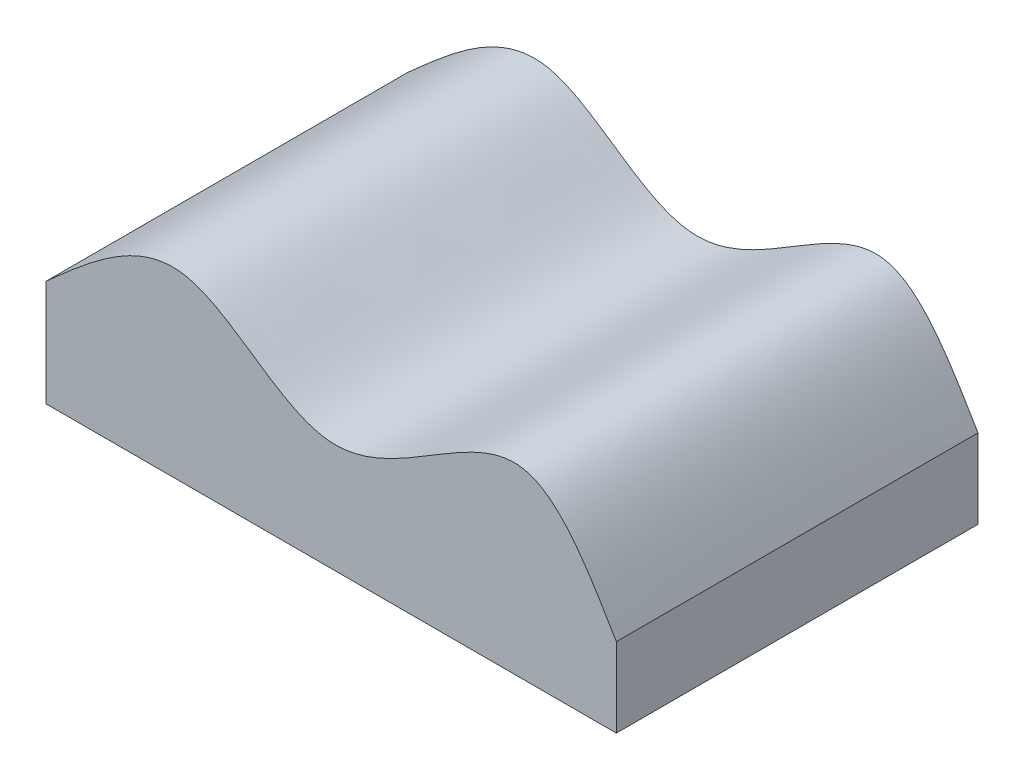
ISO-10303-21;
HEADER;
FILE_DESCRIPTION(('STEP AP214'),'2;1');
FILE_NAME('part.step','',(''),(''),'','','');
FILE_SCHEMA(('AUTOMOTIVE_DESIGN { 1 0 10303 214 1 1 1 1 }'));
ENDSEC;
DATA;
#1=APPLICATION_CONTEXT('core data for automotive mechanical design processes');
#2=APPLICATION_PROTOCOL_DEFINITION('international standard','automotive_design',2000,#1);
#3=PRODUCT_CONTEXT('',#1,'mechanical');
#4=PRODUCT('Part','Part','',(#3));
#5=PRODUCT_RELATED_PRODUCT_CATEGORY('part','',(#4));
#6=PRODUCT_DEFINITION_FORMATION('','',#4);
#7=PRODUCT_DEFINITION_CONTEXT('part definition',#1,'design');
#8=PRODUCT_DEFINITION('design','',#6,#7);
#9=PRODUCT_DEFINITION_SHAPE('','',#8);
#10=(LENGTH_UNIT() NAMED_UNIT(*) SI_UNIT(.MILLI.,.METRE.));
#11=(NAMED_UNIT(*) PLANE_ANGLE_UNIT() SI_UNIT($,.RADIAN.));
#12=(NAMED_UNIT(*) SI_UNIT($,.STERADIAN.) SOLID_ANGLE_UNIT());
#13=UNCERTAINTY_MEASURE_WITH_UNIT(LENGTH_MEASURE(1.E-05),#10,'distance_accuracy_value','');
#14=(GEOMETRIC_REPRESENTATION_CONTEXT(3) GLOBAL_UNCERTAINTY_ASSIGNED_CONTEXT((#13)) GLOBAL_UNIT_ASSIGNED_CONTEXT((#10,
#11,#12)) REPRESENTATION_CONTEXT('',''));
#15=CARTESIAN_POINT('',(0.,0.,0.));
#16=DIRECTION('',(0.,0.,1.));
#17=DIRECTION('',(1.,0.,0.));
#18=AXIS2_PLACEMENT_3D('',#15,#16,#17);
#19=CARTESIAN_POINT('',(55.9861591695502,0.,35.5));
#20=DIRECTION('',(-1.,0.,0.));
#21=DIRECTION('',(0.,0.,1.));
#22=AXIS2_PLACEMENT_3D('',#19,#20,#21);
#23=PLANE('',#22);
#24=DIRECTION('',(0.,1.,0.));
#25=VECTOR('',#24,1.);
#26=CARTESIAN_POINT('',(55.9861591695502,0.,-35.5));
#27=LINE('',#26,#25);
#28=CARTESIAN_POINT('',(55.9861591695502,0.,-35.5));
#29=VERTEX_POINT('',#28);
#30=CARTESIAN_POINT('',(55.9861591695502,15.5517108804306,-35.5));
#31=VERTEX_POINT('',#30);
#32=EDGE_CURVE('E98',#29,#31,#27,.T.);
#33=ORIENTED_EDGE('',*,*,#32,.T.);
#34=DIRECTION('',(0.,0.,-1.));
#35=VECTOR('',#34,1.);
#36=CARTESIAN_POINT('',(55.9861591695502,15.5517108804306,35.5));
#37=LINE('',#36,#35);
#38=CARTESIAN_POINT('',(55.9861591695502,15.5517108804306,35.5));
#39=VERTEX_POINT('',#38);
#40=EDGE_CURVE('E11',#39,#31,#37,.T.);
#41=ORIENTED_EDGE('',*,*,#40,.F.);
#42=DIRECTION('',(0.,1.,0.));
#43=VECTOR('',#42,1.);
#44=CARTESIAN_POINT('',(55.9861591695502,0.,35.5));
#45=LINE('',#44,#43);
#46=CARTESIAN_POINT('',(55.9861591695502,0.,35.5));
#47=VERTEX_POINT('',#46);
#48=EDGE_CURVE('E83',#47,#39,#45,.T.);
#49=ORIENTED_EDGE('',*,*,#48,.F.);
#50=DIRECTION('',(0.,0.,-1.));
#51=VECTOR('',#50,1.);
#52=CARTESIAN_POINT('',(55.9861591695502,0.,35.5));
#53=LINE('',#52,#51);
#54=EDGE_CURVE('E91',#47,#29,#53,.T.);
#55=ORIENTED_EDGE('',*,*,#54,.T.);
#56=EDGE_LOOP('',(#33,#41,#49,#55));
#57=FACE_BOUND('',#56,.T.);
#58=ADVANCED_FACE('F32',(#57),#23,.F.);
#59=CARTESIAN_POINT('',(55.9861591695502,15.5517108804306,35.5));
#60=CARTESIAN_POINT('',(50.3042531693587,25.2107971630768,35.5));
#61=CARTESIAN_POINT('',(36.3909910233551,48.8629659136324,35.5));
#62=CARTESIAN_POINT('',(1.40554862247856,7.26706724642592,35.5));
#63=CARTESIAN_POINT('',(-28.4752897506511,45.4255632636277,35.5));
#64=CARTESIAN_POINT('',(-46.9508395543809,28.9140942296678,35.5));
#65=CARTESIAN_POINT('',(-55.9861591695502,20.839292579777,35.5));
#66=B_SPLINE_CURVE_WITH_KNOTS('',3,(#59,#60,#61,#62,#63,#64,#65),.UNSPECIFIED.,.F.,.F.,(4,1,1,1,
4),(0.,0.211458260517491,0.517797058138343,0.76418251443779,1.),.UNSPECIFIED.);
#67=DIRECTION('',(0.,0.,-1.));
#68=VECTOR('',#67,1.);
#69=SURFACE_OF_LINEAR_EXTRUSION('',#66,#68);
#70=CARTESIAN_POINT('',(55.9861591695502,15.5517108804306,-35.5));
#71=CARTESIAN_POINT('',(50.3042531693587,25.2107971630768,-35.5));
#72=CARTESIAN_POINT('',(36.3909910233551,48.8629659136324,-35.5));
#73=CARTESIAN_POINT('',(1.40554862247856,7.26706724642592,-35.5));
#74=CARTESIAN_POINT('',(-28.4752897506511,45.4255632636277,-35.5));
#75=CARTESIAN_POINT('',(-46.9508395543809,28.9140942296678,-35.5));
#76=CARTESIAN_POINT('',(-55.9861591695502,20.839292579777,-35.5));
#77=B_SPLINE_CURVE_WITH_KNOTS('',3,(#70,#71,#72,#73,#74,#75,#76),.UNSPECIFIED.,.F.,.F.,(4,1,1,1,
4),(0.,0.211458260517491,0.517797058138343,0.76418251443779,1.),.UNSPECIFIED.);
#78=CARTESIAN_POINT('',(-55.9861591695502,20.839292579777,-35.5));
#79=VERTEX_POINT('',#78);
#80=EDGE_CURVE('E87',#31,#79,#77,.T.);
#81=ORIENTED_EDGE('',*,*,#80,.T.);
#82=DIRECTION('',(0.,0.,-1.));
#83=VECTOR('',#82,1.);
#84=CARTESIAN_POINT('',(-55.9861591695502,20.839292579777,35.5));
#85=LINE('',#84,#83);
#86=CARTESIAN_POINT('',(-55.9861591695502,20.839292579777,35.5));
#87=VERTEX_POINT('',#86);
#88=EDGE_CURVE('E40',#87,#79,#85,.T.);
#89=ORIENTED_EDGE('',*,*,#88,.F.);
#90=EDGE_CURVE('E78',#39,#87,#66,.T.);
#91=ORIENTED_EDGE('',*,*,#90,.F.);
#92=ORIENTED_EDGE('',*,*,#40,.T.);
#93=EDGE_LOOP('',(#81,#89,#91,#92));
#94=FACE_BOUND('',#93,.T.);
#95=ADVANCED_FACE('F86',(#94),#69,.F.);
#96=CARTESIAN_POINT('',(-55.9861591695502,20.839292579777,35.5));
#97=DIRECTION('',(1.,0.,0.));
#98=DIRECTION('',(0.,0.,-1.));
#99=AXIS2_PLACEMENT_3D('',#96,#97,#98);
#100=PLANE('',#99);
#101=DIRECTION('',(0.,-1.,0.));
#102=VECTOR('',#101,1.);
#103=CARTESIAN_POINT('',(-55.9861591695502,20.839292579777,-35.5));
#104=LINE('',#103,#102);
#105=CARTESIAN_POINT('',(-55.9861591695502,0.,-35.5));
#106=VERTEX_POINT('',#105);
#107=EDGE_CURVE('E65',#79,#106,#104,.T.);
#108=ORIENTED_EDGE('',*,*,#107,.T.);
#109=DIRECTION('',(0.,0.,-1.));
#110=VECTOR('',#109,1.);
#111=CARTESIAN_POINT('',(-55.9861591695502,0.,35.5));
#112=LINE('',#111,#110);
#113=CARTESIAN_POINT('',(-55.9861591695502,0.,35.5));
#114=VERTEX_POINT('',#113);
#115=EDGE_CURVE('E88',#114,#106,#112,.T.);
#116=ORIENTED_EDGE('',*,*,#115,.F.);
#117=DIRECTION('',(0.,-1.,0.));
#118=VECTOR('',#117,1.);
#119=CARTESIAN_POINT('',(-55.9861591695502,20.839292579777,35.5));
#120=LINE('',#119,#118);
#121=EDGE_CURVE('E81',#87,#114,#120,.T.);
#122=ORIENTED_EDGE('',*,*,#121,.F.);
#123=ORIENTED_EDGE('',*,*,#88,.T.);
#124=EDGE_LOOP('',(#108,#116,#122,#123));
#125=FACE_BOUND('',#124,.T.);
#126=ADVANCED_FACE('F89',(#125),#100,.F.);
#127=CARTESIAN_POINT('',(55.9861591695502,0.,35.5));
#128=DIRECTION('',(0.,1.,0.));
#129=DIRECTION('',(0.,0.,1.));
#130=AXIS2_PLACEMENT_3D('',#127,#128,#129);
#131=PLANE('',#130);
#132=DIRECTION('',(1.,0.,0.));
#133=VECTOR('',#132,1.);
#134=CARTESIAN_POINT('',(55.9861591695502,0.,-35.5));
#135=LINE('',#134,#133);
#136=EDGE_CURVE('E71',#106,#29,#135,.T.);
#137=ORIENTED_EDGE('',*,*,#136,.T.);
#138=ORIENTED_EDGE('',*,*,#54,.F.);
#139=DIRECTION('',(1.,0.,0.));
#140=VECTOR('',#139,1.);
#141=CARTESIAN_POINT('',(55.9861591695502,0.,35.5));
#142=LINE('',#141,#140);
#143=EDGE_CURVE('E48',#114,#47,#142,.T.);
#144=ORIENTED_EDGE('',*,*,#143,.F.);
#145=ORIENTED_EDGE('',*,*,#115,.T.);
#146=EDGE_LOOP('',(#137,#138,#144,#145));
#147=FACE_BOUND('',#146,.T.);
#148=ADVANCED_FACE('F110',(#147),#131,.F.);
#149=CARTESIAN_POINT('',(2.22354720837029,21.49466741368,35.5));
#150=DIRECTION('',(0.,0.,-1.));
#151=DIRECTION('',(-1.,0.,0.));
#152=AXIS2_PLACEMENT_3D('',#149,#150,#151);
#153=PLANE('',#152);
#154=ORIENTED_EDGE('',*,*,#48,.T.);
#155=ORIENTED_EDGE('',*,*,#90,.T.);
#156=ORIENTED_EDGE('',*,*,#121,.T.);
#157=ORIENTED_EDGE('',*,*,#143,.T.);
#158=EDGE_LOOP('',(#154,#155,#156,#157));
#159=FACE_BOUND('',#158,.T.);
#160=ADVANCED_FACE('F79',(#159),#153,.F.);
#161=CARTESIAN_POINT('',(2.22354720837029,21.49466741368,-35.5));
#162=DIRECTION('',(0.,0.,-1.));
#163=DIRECTION('',(-1.,0.,0.));
#164=AXIS2_PLACEMENT_3D('',#161,#162,#163);
#165=PLANE('',#164);
#166=ORIENTED_EDGE('',*,*,#32,.F.);
#167=ORIENTED_EDGE('',*,*,#136,.F.);
#168=ORIENTED_EDGE('',*,*,#107,.F.);
#169=ORIENTED_EDGE('',*,*,#80,.F.);
#170=EDGE_LOOP('',(#166,#167,#168,#169));
#171=FACE_BOUND('',#170,.T.);
#172=ADVANCED_FACE('F113',(#171),#165,.T.);
#173=CLOSED_SHELL('',(#58,#95,#126,#148,#160,#172));
#174=MANIFOLD_SOLID_BREP('B2',#173);
#175=ADVANCED_BREP_SHAPE_REPRESENTATION('',(#18,#174),#14);
#176=SHAPE_DEFINITION_REPRESENTATION(#9,#175);
ENDSEC;
END-ISO-10303-21;
